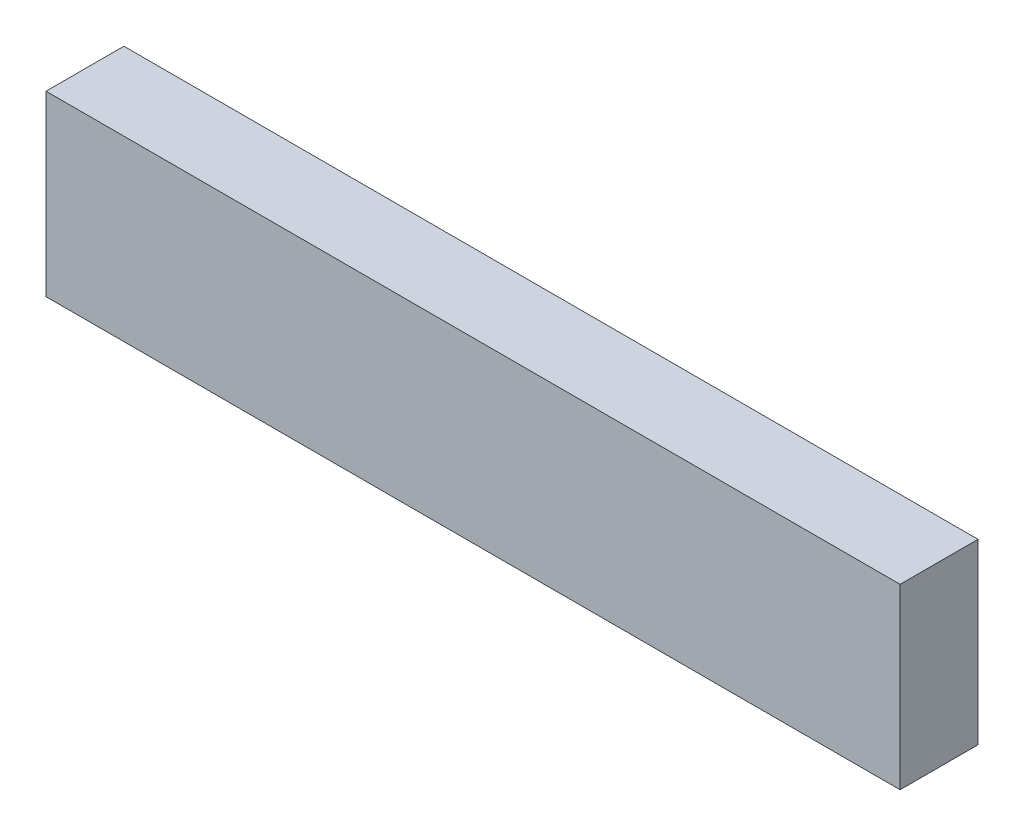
ISO-10303-21;
HEADER;
FILE_DESCRIPTION(('STEP AP214'),'2;1');
FILE_NAME('part.step','',(''),(''),'','','');
FILE_SCHEMA(('AUTOMOTIVE_DESIGN { 1 0 10303 214 1 1 1 1 }'));
ENDSEC;
DATA;
#1=APPLICATION_CONTEXT('core data for automotive mechanical design processes');
#2=APPLICATION_PROTOCOL_DEFINITION('international standard','automotive_design',2000,#1);
#3=PRODUCT_CONTEXT('',#1,'mechanical');
#4=PRODUCT('Part','Part','',(#3));
#5=PRODUCT_RELATED_PRODUCT_CATEGORY('part','',(#4));
#6=PRODUCT_DEFINITION_FORMATION('','',#4);
#7=PRODUCT_DEFINITION_CONTEXT('part definition',#1,'design');
#8=PRODUCT_DEFINITION('design','',#6,#7);
#9=PRODUCT_DEFINITION_SHAPE('','',#8);
#10=(LENGTH_UNIT() NAMED_UNIT(*) SI_UNIT(.MILLI.,.METRE.));
#11=(NAMED_UNIT(*) PLANE_ANGLE_UNIT() SI_UNIT($,.RADIAN.));
#12=(NAMED_UNIT(*) SI_UNIT($,.STERADIAN.) SOLID_ANGLE_UNIT());
#13=UNCERTAINTY_MEASURE_WITH_UNIT(LENGTH_MEASURE(1.E-05),#10,'distance_accuracy_value','');
#14=(GEOMETRIC_REPRESENTATION_CONTEXT(3) GLOBAL_UNCERTAINTY_ASSIGNED_CONTEXT((#13)) GLOBAL_UNIT_ASSIGNED_CONTEXT((#10,
#11,#12)) REPRESENTATION_CONTEXT('',''));
#15=CARTESIAN_POINT('',(0.,0.,0.));
#16=DIRECTION('',(0.,0.,1.));
#17=DIRECTION('',(1.,0.,0.));
#18=AXIS2_PLACEMENT_3D('',#15,#16,#17);
#19=CARTESIAN_POINT('',(0.,-3.91893900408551E-13,13.9));
#20=DIRECTION('',(0.,0.,-1.));
#21=DIRECTION('',(0.,1.,0.));
#22=AXIS2_PLACEMENT_3D('',#19,#20,#21);
#23=PLANE('',#22);
#24=DIRECTION('',(1.,0.,0.));
#25=VECTOR('',#24,1.);
#26=CARTESIAN_POINT('',(-76.2,15.8749999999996,13.9000000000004));
#27=LINE('',#26,#25);
#28=CARTESIAN_POINT('',(-76.2,15.8749999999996,13.9000000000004));
#29=VERTEX_POINT('',#28);
#30=CARTESIAN_POINT('',(76.2,15.8749999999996,13.9000000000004));
#31=VERTEX_POINT('',#30);
#32=EDGE_CURVE('E66',#29,#31,#27,.T.);
#33=ORIENTED_EDGE('',*,*,#32,.F.);
#34=DIRECTION('',(0.,1.,0.));
#35=VECTOR('',#34,1.);
#36=CARTESIAN_POINT('',(-76.2,-15.8750000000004,13.8999999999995));
#37=LINE('',#36,#35);
#38=CARTESIAN_POINT('',(-76.2,-15.8750000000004,13.8999999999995));
#39=VERTEX_POINT('',#38);
#40=EDGE_CURVE('E74',#39,#29,#37,.T.);
#41=ORIENTED_EDGE('',*,*,#40,.F.);
#42=DIRECTION('',(-1.,0.,0.));
#43=VECTOR('',#42,1.);
#44=CARTESIAN_POINT('',(76.2,-15.8750000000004,13.8999999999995));
#45=LINE('',#44,#43);
#46=CARTESIAN_POINT('',(76.2,-15.8750000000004,13.8999999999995));
#47=VERTEX_POINT('',#46);
#48=EDGE_CURVE('E68',#47,#39,#45,.T.);
#49=ORIENTED_EDGE('',*,*,#48,.F.);
#50=DIRECTION('',(0.,-1.,0.));
#51=VECTOR('',#50,1.);
#52=CARTESIAN_POINT('',(76.2,15.8749999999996,13.9000000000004));
#53=LINE('',#52,#51);
#54=EDGE_CURVE('E54',#31,#47,#53,.T.);
#55=ORIENTED_EDGE('',*,*,#54,.F.);
#56=EDGE_LOOP('',(#33,#41,#49,#55));
#57=FACE_BOUND('',#56,.T.);
#58=ADVANCED_FACE('F14',(#57),#23,.F.);
#59=CARTESIAN_POINT('',(76.2,15.875,4.47558656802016E-13));
#60=DIRECTION('',(1.,0.,0.));
#61=DIRECTION('',(0.,1.,0.));
#62=AXIS2_PLACEMENT_3D('',#59,#60,#61);
#63=PLANE('',#62);
#64=DIRECTION('',(0.,0.,1.));
#65=VECTOR('',#64,1.);
#66=CARTESIAN_POINT('',(76.2,15.875,4.47558656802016E-13));
#67=LINE('',#66,#65);
#68=CARTESIAN_POINT('',(76.2,15.875,4.47558656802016E-13));
#69=VERTEX_POINT('',#68);
#70=EDGE_CURVE('E18',#69,#31,#67,.T.);
#71=ORIENTED_EDGE('',*,*,#70,.T.);
#72=ORIENTED_EDGE('',*,*,#54,.T.);
#73=DIRECTION('',(0.,0.,1.));
#74=VECTOR('',#73,1.);
#75=CARTESIAN_POINT('',(76.2,-15.875,-4.47558656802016E-13));
#76=LINE('',#75,#74);
#77=CARTESIAN_POINT('',(76.2,-15.875,-4.47558656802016E-13));
#78=VERTEX_POINT('',#77);
#79=EDGE_CURVE('E9',#78,#47,#76,.T.);
#80=ORIENTED_EDGE('',*,*,#79,.F.);
#81=DIRECTION('',(0.,1.,0.));
#82=VECTOR('',#81,1.);
#83=CARTESIAN_POINT('',(76.2,15.875,4.47558656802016E-13));
#84=LINE('',#83,#82);
#85=EDGE_CURVE('E55',#78,#69,#84,.T.);
#86=ORIENTED_EDGE('',*,*,#85,.T.);
#87=EDGE_LOOP('',(#71,#72,#80,#86));
#88=FACE_BOUND('',#87,.T.);
#89=ADVANCED_FACE('F16',(#88),#63,.T.);
#90=CARTESIAN_POINT('',(-76.2,-15.875,-4.47558656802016E-13));
#91=DIRECTION('',(0.,-1.,0.));
#92=DIRECTION('',(1.,0.,0.));
#93=AXIS2_PLACEMENT_3D('',#90,#91,#92);
#94=PLANE('',#93);
#95=ORIENTED_EDGE('',*,*,#48,.T.);
#96=DIRECTION('',(0.,0.,1.));
#97=VECTOR('',#96,1.);
#98=CARTESIAN_POINT('',(-76.2,-15.875,-4.47558656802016E-13));
#99=LINE('',#98,#97);
#100=CARTESIAN_POINT('',(-76.2,-15.875,-4.47558656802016E-13));
#101=VERTEX_POINT('',#100);
#102=EDGE_CURVE('E23',#101,#39,#99,.T.);
#103=ORIENTED_EDGE('',*,*,#102,.F.);
#104=DIRECTION('',(1.,0.,0.));
#105=VECTOR('',#104,1.);
#106=CARTESIAN_POINT('',(-76.2,-15.875,-4.47558656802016E-13));
#107=LINE('',#106,#105);
#108=EDGE_CURVE('E61',#101,#78,#107,.T.);
#109=ORIENTED_EDGE('',*,*,#108,.T.);
#110=ORIENTED_EDGE('',*,*,#79,.T.);
#111=EDGE_LOOP('',(#95,#103,#109,#110));
#112=FACE_BOUND('',#111,.T.);
#113=ADVANCED_FACE('F86',(#112),#94,.T.);
#114=CARTESIAN_POINT('',(-76.2,15.875,4.47558656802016E-13));
#115=DIRECTION('',(-1.,0.,0.));
#116=DIRECTION('',(0.,-1.,0.));
#117=AXIS2_PLACEMENT_3D('',#114,#115,#116);
#118=PLANE('',#117);
#119=ORIENTED_EDGE('',*,*,#102,.T.);
#120=ORIENTED_EDGE('',*,*,#40,.T.);
#121=DIRECTION('',(0.,0.,1.));
#122=VECTOR('',#121,1.);
#123=CARTESIAN_POINT('',(-76.2,15.875,4.47558656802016E-13));
#124=LINE('',#123,#122);
#125=CARTESIAN_POINT('',(-76.2,15.875,4.47558656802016E-13));
#126=VERTEX_POINT('',#125);
#127=EDGE_CURVE('E60',#126,#29,#124,.T.);
#128=ORIENTED_EDGE('',*,*,#127,.F.);
#129=DIRECTION('',(0.,-1.,0.));
#130=VECTOR('',#129,1.);
#131=CARTESIAN_POINT('',(-76.2,15.875,4.47558656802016E-13));
#132=LINE('',#131,#130);
#133=EDGE_CURVE('E79',#126,#101,#132,.T.);
#134=ORIENTED_EDGE('',*,*,#133,.T.);
#135=EDGE_LOOP('',(#119,#120,#128,#134));
#136=FACE_BOUND('',#135,.T.);
#137=ADVANCED_FACE('F83',(#136),#118,.T.);
#138=CARTESIAN_POINT('',(-76.2,15.875,4.47558656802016E-13));
#139=DIRECTION('',(0.,1.,0.));
#140=DIRECTION('',(-1.,0.,0.));
#141=AXIS2_PLACEMENT_3D('',#138,#139,#140);
#142=PLANE('',#141);
#143=ORIENTED_EDGE('',*,*,#32,.T.);
#144=ORIENTED_EDGE('',*,*,#70,.F.);
#145=DIRECTION('',(-1.,0.,0.));
#146=VECTOR('',#145,1.);
#147=CARTESIAN_POINT('',(-76.2,15.875,4.47558656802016E-13));
#148=LINE('',#147,#146);
#149=EDGE_CURVE('E77',#69,#126,#148,.T.);
#150=ORIENTED_EDGE('',*,*,#149,.T.);
#151=ORIENTED_EDGE('',*,*,#127,.T.);
#152=EDGE_LOOP('',(#143,#144,#150,#151));
#153=FACE_BOUND('',#152,.T.);
#154=ADVANCED_FACE('F70',(#153),#142,.T.);
#155=CARTESIAN_POINT('',(0.,0.,0.));
#156=DIRECTION('',(0.,0.,1.));
#157=DIRECTION('',(0.,-1.,0.));
#158=AXIS2_PLACEMENT_3D('',#155,#156,#157);
#159=PLANE('',#158);
#160=ORIENTED_EDGE('',*,*,#85,.F.);
#161=ORIENTED_EDGE('',*,*,#108,.F.);
#162=ORIENTED_EDGE('',*,*,#133,.F.);
#163=ORIENTED_EDGE('',*,*,#149,.F.);
#164=EDGE_LOOP('',(#160,#161,#162,#163));
#165=FACE_BOUND('',#164,.T.);
#166=ADVANCED_FACE('F88',(#165),#159,.F.);
#167=CLOSED_SHELL('',(#58,#89,#113,#137,#154,#166));
#168=MANIFOLD_SOLID_BREP('B1',#167);
#169=ADVANCED_BREP_SHAPE_REPRESENTATION('',(#18,#168),#14);
#170=SHAPE_DEFINITION_REPRESENTATION(#9,#169);
ENDSEC;
END-ISO-10303-21;
